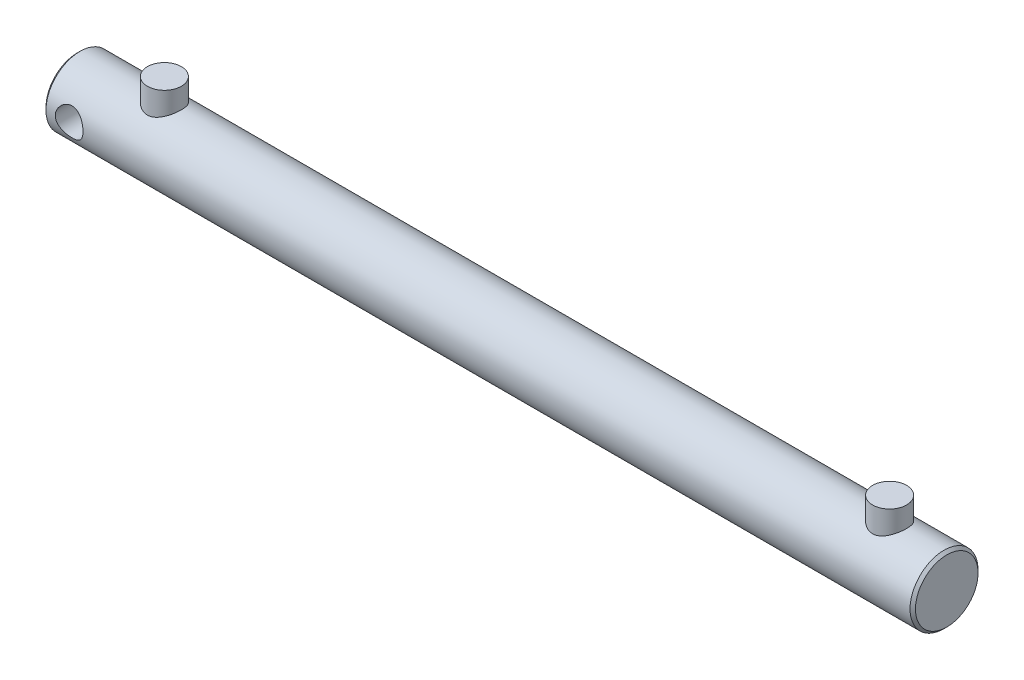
from build123d import *

# Parameters (mm, degrees)
ESQUISSE1_W                  = 639
ESQUISSE1_H                  = 25
CHANFREIN1_SIZE              = 2
ENL_V_MAT_EXTRU_1_DEPTH      = 322.450229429
ENL_V_MAT_EXTRU_1_DEPTH_BACK = 322.450229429
ESQUISSE3_R                  = 10.2
ESQUISSE5_R                  = 12.5
EXTRUSION2_DEPTH             = 40


with BuildPart() as part:
    # Esquisse1 → R_volution1 (revolve)
    with BuildSketch(Plane.XY, mode=Mode.PRIVATE) as r_volution1_sk:
        with Locations((0, 12.5)):
            Rectangle(ESQUISSE1_W, ESQUISSE1_H)
    revolve(r_volution1_sk.sketch.rotate(Axis((-319.5, 0, 0), (1, 0, 0)), 90), axis=Axis((-319.5, 0, 0), (1, 0, 0)))

    # Chanfrein1
    chanfrein1_edges = [part.edges().sort_by_distance(p)[0] for p in [
        (319.5, 0, -25),
        (-319.5, 0, -25),
    ]]
    chamfer(chanfrein1_edges, length=CHANFREIN1_SIZE)

    # Esquisse3 → Enl_v. mat.-Extru.1 (cut, two sides: drawn at the far end of the back side and taken through both)
    with BuildSketch(Plane.XY.offset(-ENL_V_MAT_EXTRU_1_DEPTH_BACK)):
        with Locations((-300.5, 0)):
            Circle(ESQUISSE3_R)
    extrude(amount=ENL_V_MAT_EXTRU_1_DEPTH + ENL_V_MAT_EXTRU_1_DEPTH_BACK, mode=Mode.SUBTRACT)

    # Esquisse5 → Extrusion2 (add)
    with BuildSketch(Plane(origin=(0, 0, 0), x_dir=(1, 0, 0), z_dir=(0, 1, 0))):
        with Locations(Location((-255.5, 0, 0), (0, 0, 90))):
            Circle(ESQUISSE5_R)
        with Locations(Location((277.5, 0, 0), (0, 0, 90))):
            Circle(ESQUISSE5_R)
    extrude(amount=EXTRUSION2_DEPTH)


solid = part.part
